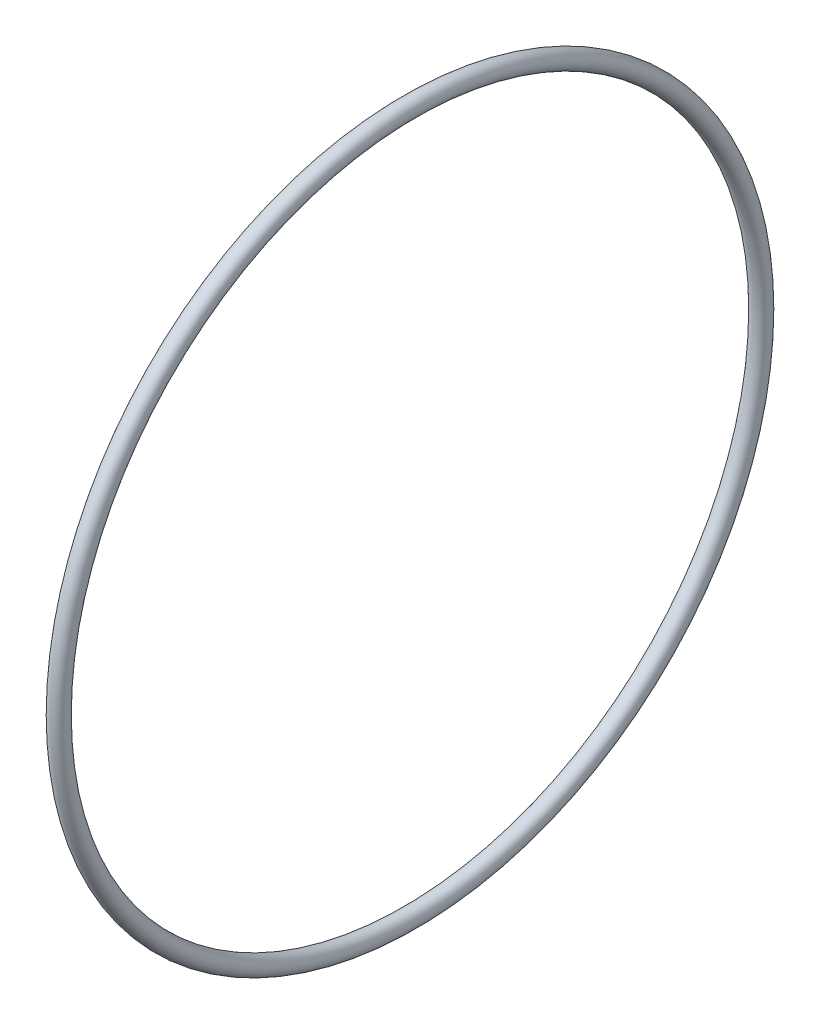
from build123d import *

# Parameters (mm, degrees)
SKETCH1_R = 1.7653


with BuildPart() as part:
    # Sketch1 → Base-Revolve (revolve)
    with BuildSketch(Plane.XY, mode=Mode.PRIVATE) as base_revolve_sk:
        with Locations((0, 69.8246)):
            Circle(SKETCH1_R)
    revolve(base_revolve_sk.sketch.rotate(Axis((0, 0, 0), (1, 0, 0)), 90), axis=Axis((0, 0, 0), (1, 0, 0)))


solid = part.part
